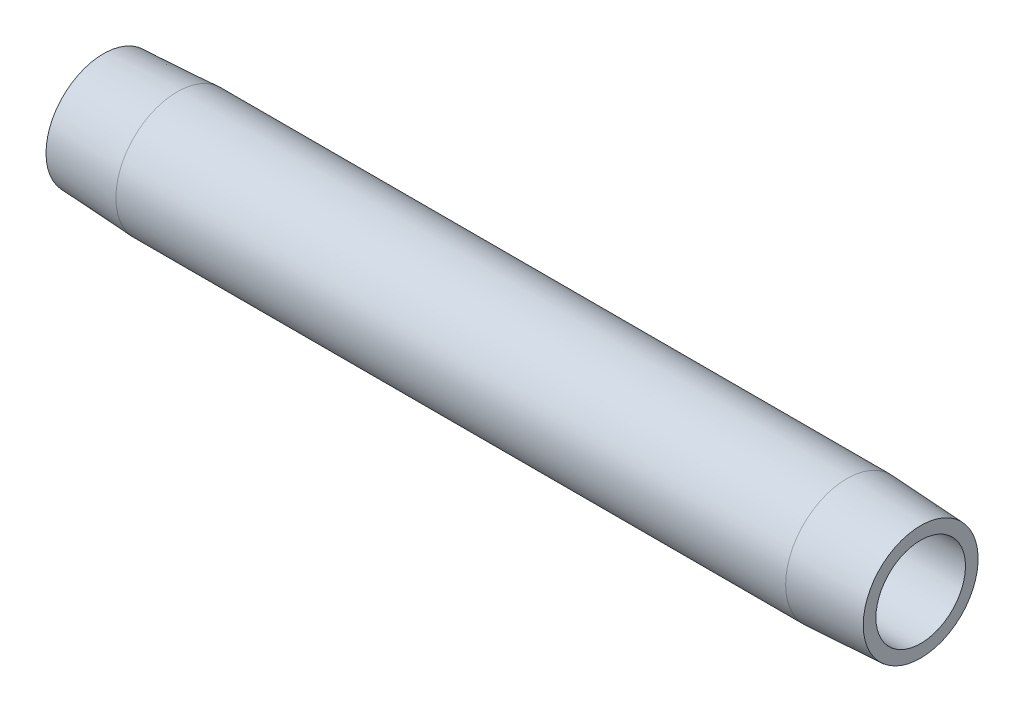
from build123d import *


with BuildPart() as part:
    # Sketch1 → Revolve1 (revolve)
    with BuildSketch(Plane.XY, mode=Mode.PRIVATE) as revolve1_sk:
        Polygon((114.3, 6.2611), (0, 6.2611), (0, 8.032050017), (10.3124, 8.5725), (103.9876, 8.5725), (114.3, 8.032050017), align=None)
    revolve(revolve1_sk.sketch.rotate(Axis((0, 0, 0), (1, 0, 0)), 90), axis=Axis((0, 0, 0), (1, 0, 0)))


solid = part.part
